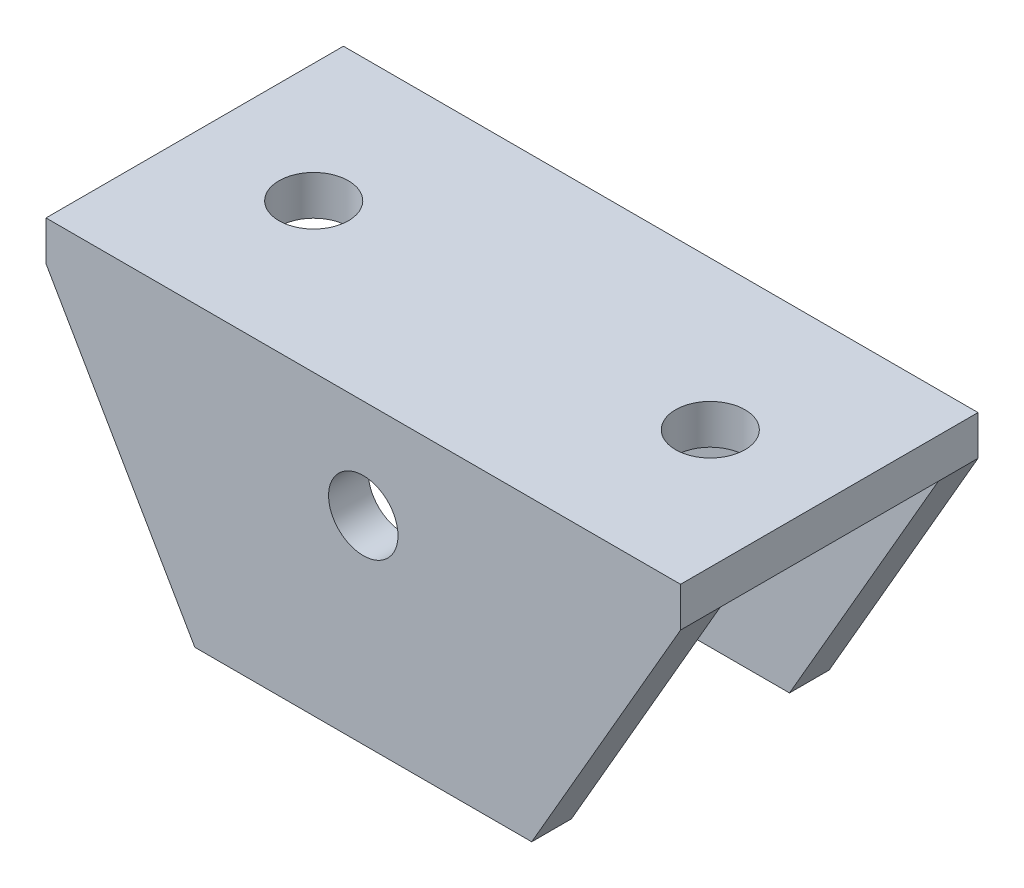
from build123d import *

# Parameters (mm, degrees)
BOSS_EXTRUDE1_DEPTH = 32
CUT_EXTRUDE1_DEPTH  = 32
SKETCH3_R           = 1.75
CUT_EXTRUDE2_DEPTH  = 32
SKETCH4_R           = 1.75
CUT_EXTRUDE3_DEPTH  = 32


with BuildPart() as part:
    # Sketch1 → Boss-Extrude1 (new body)
    with BuildSketch(Plane(origin=(0, 0, 0), x_dir=(0, 0, -1), z_dir=(1, 0, 0))):
        Polygon((0, 0), (0, 15), (15, 15), (15, 0), (13, 0), (13, 13), (2, 13), (2, 0), align=None)
    extrude(amount=BOSS_EXTRUDE1_DEPTH)

    # Sketch2 → Cut-Extrude1 (cut)
    with BuildSketch(Plane.XY):
        Polygon((7.505553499, 0), (0, 0), (0, 13), align=None)
        Polygon((32, 0), (24.494446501, 0), (32, 13), align=None)
    extrude(amount=-CUT_EXTRUDE1_DEPTH, mode=Mode.SUBTRACT)

    # Sketch3 → Cut-Extrude2 (cut)
    with BuildSketch(Plane(origin=(0, 15, 0), x_dir=(1, 0, 0), z_dir=(0, 1, 0))):
        with Locations(Location((6, 7.5, 0), (0, 0, 270))):
            Circle(SKETCH3_R)
        with Locations(Location((26, 7.5, 0), (0, 0, 270))):
            Circle(SKETCH3_R)
    extrude(amount=-CUT_EXTRUDE2_DEPTH, mode=Mode.SUBTRACT)

    # Sketch4 → Cut-Extrude3 (cut)
    with BuildSketch(Plane.XY):
        with Locations((16, 10)):
            Circle(SKETCH4_R)
    extrude(amount=-CUT_EXTRUDE3_DEPTH, mode=Mode.SUBTRACT)


solid = part.part
